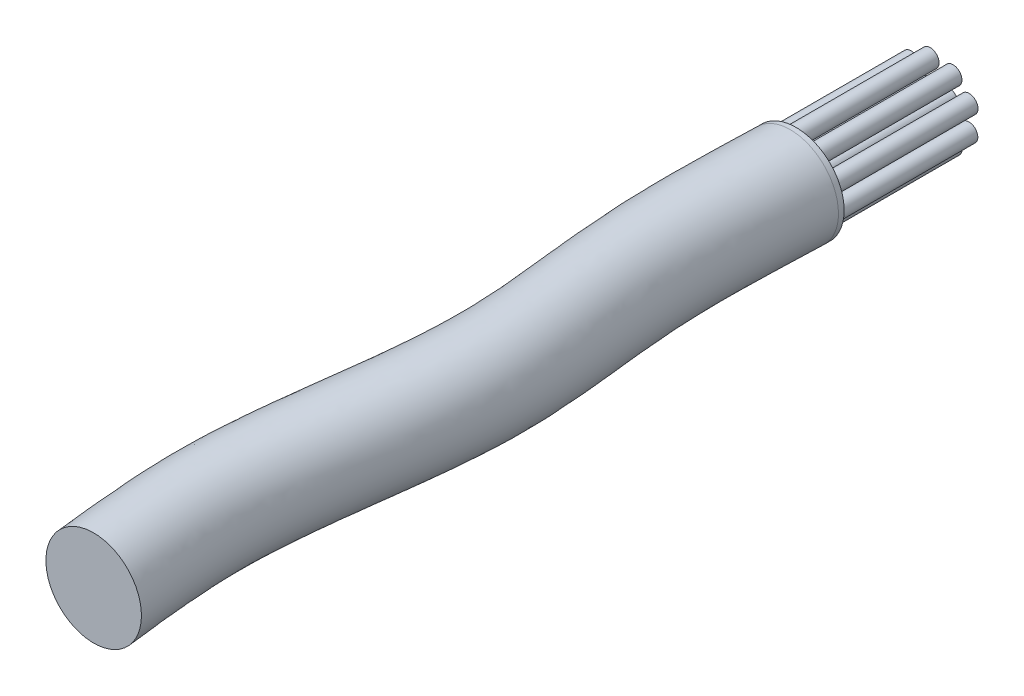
ISO-10303-21;
HEADER;
FILE_DESCRIPTION(('STEP AP214'),'2;1');
FILE_NAME('part.step','',(''),(''),'','','');
FILE_SCHEMA(('AUTOMOTIVE_DESIGN { 1 0 10303 214 1 1 1 1 }'));
ENDSEC;
DATA;
#1=APPLICATION_CONTEXT('core data for automotive mechanical design processes');
#2=APPLICATION_PROTOCOL_DEFINITION('international standard','automotive_design',2000,#1);
#3=PRODUCT_CONTEXT('',#1,'mechanical');
#4=PRODUCT('Part','Part','',(#3));
#5=PRODUCT_RELATED_PRODUCT_CATEGORY('part','',(#4));
#6=PRODUCT_DEFINITION_FORMATION('','',#4);
#7=PRODUCT_DEFINITION_CONTEXT('part definition',#1,'design');
#8=PRODUCT_DEFINITION('design','',#6,#7);
#9=PRODUCT_DEFINITION_SHAPE('','',#8);
#10=(LENGTH_UNIT() NAMED_UNIT(*) SI_UNIT(.MILLI.,.METRE.));
#11=(NAMED_UNIT(*) PLANE_ANGLE_UNIT() SI_UNIT($,.RADIAN.));
#12=(NAMED_UNIT(*) SI_UNIT($,.STERADIAN.) SOLID_ANGLE_UNIT());
#13=UNCERTAINTY_MEASURE_WITH_UNIT(LENGTH_MEASURE(1.E-05),#10,'distance_accuracy_value','');
#14=(GEOMETRIC_REPRESENTATION_CONTEXT(3) GLOBAL_UNCERTAINTY_ASSIGNED_CONTEXT((#13)) GLOBAL_UNIT_ASSIGNED_CONTEXT((#10,
#11,#12)) REPRESENTATION_CONTEXT('',''));
#15=CARTESIAN_POINT('',(0.,0.,0.));
#16=DIRECTION('',(0.,0.,1.));
#17=DIRECTION('',(1.,0.,0.));
#18=AXIS2_PLACEMENT_3D('',#15,#16,#17);
#19=CARTESIAN_POINT('',(-3.457918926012,0.,-50.4254425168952));
#20=DIRECTION('',(0.,0.,1.));
#21=DIRECTION('',(0.,-1.00000000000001,0.));
#22=AXIS2_PLACEMENT_3D('',#19,#20,#21);
#23=PLANE('',#22);
#24=CARTESIAN_POINT('',(-0.550298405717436,-2.32426928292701,-50.4254425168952));
#25=DIRECTION('',(0.,0.,1.));
#26=DIRECTION('',(0.,-1.00000000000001,0.));
#27=AXIS2_PLACEMENT_3D('',#24,#25,#26);
#28=CIRCLE('',#27,0.635);
#29=CARTESIAN_POINT('',(-0.550298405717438,-2.95926928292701,-50.4254425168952));
#30=VERTEX_POINT('',#29);
#31=EDGE_CURVE('E24',#30,#30,#28,.F.);
#32=ORIENTED_EDGE('',*,*,#31,.F.);
#33=EDGE_LOOP('',(#32));
#34=FACE_BOUND('',#33,.T.);
#35=CARTESIAN_POINT('',(0.847747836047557,0.566836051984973,-50.4254425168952));
#36=DIRECTION('',(0.,0.,1.));
#37=DIRECTION('',(0.,-1.00000000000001,0.));
#38=AXIS2_PLACEMENT_3D('',#35,#36,#37);
#39=CIRCLE('',#38,0.635);
#40=CARTESIAN_POINT('',(0.847747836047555,-0.0681639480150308,-50.4254425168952));
#41=VERTEX_POINT('',#40);
#42=EDGE_CURVE('E32',#41,#41,#39,.F.);
#43=ORIENTED_EDGE('',*,*,#42,.F.);
#44=EDGE_LOOP('',(#43));
#45=FACE_BOUND('',#44,.T.);
#46=CARTESIAN_POINT('',(-1.89405158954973,1.53053783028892,-50.4254425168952));
#47=DIRECTION('',(0.,0.,1.));
#48=DIRECTION('',(0.,-1.00000000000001,0.));
#49=AXIS2_PLACEMENT_3D('',#46,#47,#48);
#50=CIRCLE('',#49,0.635);
#51=CARTESIAN_POINT('',(-1.89405158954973,0.895537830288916,-50.4254425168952));
#52=VERTEX_POINT('',#51);
#53=EDGE_CURVE('E40',#52,#52,#50,.F.);
#54=ORIENTED_EDGE('',*,*,#53,.F.);
#55=EDGE_LOOP('',(#54));
#56=FACE_BOUND('',#55,.T.);
#57=CARTESIAN_POINT('',(-1.93477138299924,-1.52344667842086,-50.4254425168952));
#58=DIRECTION('',(0.,0.,1.));
#59=DIRECTION('',(0.,-1.00000000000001,0.));
#60=AXIS2_PLACEMENT_3D('',#57,#58,#59);
#61=CIRCLE('',#60,0.635);
#62=CARTESIAN_POINT('',(-1.93477138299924,-2.15844667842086,-50.4254425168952));
#63=VERTEX_POINT('',#62);
#64=EDGE_CURVE('E46',#63,#63,#61,.F.);
#65=ORIENTED_EDGE('',*,*,#64,.F.);
#66=EDGE_LOOP('',(#65));
#67=FACE_BOUND('',#66,.T.);
#68=CARTESIAN_POINT('',(2.25936734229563,-0.817636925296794,-50.4254425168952));
#69=DIRECTION('',(0.,0.,1.));
#70=DIRECTION('',(0.,-1.00000000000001,0.));
#71=AXIS2_PLACEMENT_3D('',#68,#69,#70);
#72=CIRCLE('',#71,0.635);
#73=CARTESIAN_POINT('',(2.25936734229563,-1.4526369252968,-50.4254425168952));
#74=VERTEX_POINT('',#73);
#75=EDGE_CURVE('E52',#74,#74,#72,.F.);
#76=ORIENTED_EDGE('',*,*,#75,.F.);
#77=EDGE_LOOP('',(#76));
#78=FACE_BOUND('',#77,.T.);
#79=CARTESIAN_POINT('',(1.11921312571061,2.16848126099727,-50.4254425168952));
#80=DIRECTION('',(0.,0.,1.));
#81=DIRECTION('',(0.,-1.00000000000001,0.));
#82=AXIS2_PLACEMENT_3D('',#79,#80,#81);
#83=CIRCLE('',#82,0.635);
#84=CARTESIAN_POINT('',(1.11921312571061,1.53348126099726,-50.4254425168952));
#85=VERTEX_POINT('',#84);
#86=EDGE_CURVE('E58',#85,#85,#83,.F.);
#87=ORIENTED_EDGE('',*,*,#86,.F.);
#88=EDGE_LOOP('',(#87));
#89=FACE_BOUND('',#88,.T.);
#90=CARTESIAN_POINT('',(3.45791892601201,0.,-50.4254425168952));
#91=CARTESIAN_POINT('',(3.45791892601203,-6.85800000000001,-50.4254425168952));
#92=CARTESIAN_POINT('',(-3.457918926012,-6.85800000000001,-50.4254425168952));
#93=CARTESIAN_POINT('',(-3.457918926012,0.,-50.4254425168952));
#94=CARTESIAN_POINT('',(-3.45791892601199,6.85799999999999,-50.4254425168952));
#95=CARTESIAN_POINT('',(3.45791892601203,6.85800000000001,-50.4254425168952));
#96=CARTESIAN_POINT('',(3.45791892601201,0.,-50.4254425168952));
#97=(BOUNDED_CURVE() B_SPLINE_CURVE(3,(#90,#91,#92,#93,#94,#95,#96),.UNSPECIFIED.,.T.,
.F.) B_SPLINE_CURVE_WITH_KNOTS((4,3,4),(0.,0.5,1.),
.UNSPECIFIED.) CURVE() GEOMETRIC_REPRESENTATION_ITEM() RATIONAL_B_SPLINE_CURVE((1.,
0.333333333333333,0.333333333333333,1.,0.333333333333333,0.333333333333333,1.)) REPRESENTATION_ITEM(''));
#98=CARTESIAN_POINT('',(3.45791892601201,0.,-50.4254425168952));
#99=VERTEX_POINT('',#98);
#100=EDGE_CURVE('E69',#99,#99,#97,.F.);
#101=ORIENTED_EDGE('',*,*,#100,.F.);
#102=EDGE_LOOP('',(#101));
#103=FACE_BOUND('',#102,.T.);
#104=CARTESIAN_POINT('',(2.2729406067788,0.960460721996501,-50.4254425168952));
#105=DIRECTION('',(0.,0.,1.));
#106=DIRECTION('',(0.,-1.00000000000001,0.));
#107=AXIS2_PLACEMENT_3D('',#104,#105,#106);
#108=CIRCLE('',#107,0.635);
#109=CARTESIAN_POINT('',(2.2729406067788,0.325460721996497,-50.4254425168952));
#110=VERTEX_POINT('',#109);
#111=EDGE_CURVE('E55',#110,#110,#108,.F.);
#112=ORIENTED_EDGE('',*,*,#111,.F.);
#113=EDGE_LOOP('',(#112));
#114=FACE_BOUND('',#113,.T.);
#115=CARTESIAN_POINT('',(1.1327863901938,-2.13424358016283,-50.4254425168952));
#116=DIRECTION('',(0.,0.,1.));
#117=DIRECTION('',(0.,-1.00000000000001,0.));
#118=AXIS2_PLACEMENT_3D('',#115,#116,#117);
#119=CIRCLE('',#118,0.635);
#120=CARTESIAN_POINT('',(1.1327863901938,-2.76924358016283,-50.4254425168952));
#121=VERTEX_POINT('',#120);
#122=EDGE_CURVE('E49',#121,#121,#119,.F.);
#123=ORIENTED_EDGE('',*,*,#122,.F.);
#124=EDGE_LOOP('',(#123));
#125=FACE_BOUND('',#124,.T.);
#126=CARTESIAN_POINT('',(-2.46412869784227,0.,-50.4254425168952));
#127=DIRECTION('',(0.,0.,1.));
#128=DIRECTION('',(0.,-1.00000000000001,0.));
#129=AXIS2_PLACEMENT_3D('',#126,#127,#128);
#130=CIRCLE('',#129,0.635);
#131=CARTESIAN_POINT('',(-2.46412869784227,-0.635000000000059,-50.4254425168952));
#132=VERTEX_POINT('',#131);
#133=EDGE_CURVE('E43',#132,#132,#130,.F.);
#134=ORIENTED_EDGE('',*,*,#133,.F.);
#135=EDGE_LOOP('',(#134));
#136=FACE_BOUND('',#135,.T.);
#137=CARTESIAN_POINT('',(-0.52315187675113,2.41280002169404,-50.4254425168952));
#138=DIRECTION('',(0.,0.,1.));
#139=DIRECTION('',(0.,-1.00000000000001,0.));
#140=AXIS2_PLACEMENT_3D('',#137,#138,#139);
#141=CIRCLE('',#140,0.635);
#142=CARTESIAN_POINT('',(-0.523151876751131,1.77780002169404,-50.4254425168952));
#143=VERTEX_POINT('',#142);
#144=EDGE_CURVE('E37',#143,#143,#141,.F.);
#145=ORIENTED_EDGE('',*,*,#144,.F.);
#146=EDGE_LOOP('',(#145));
#147=FACE_BOUND('',#146,.T.);
#148=CARTESIAN_POINT('',(0.,-0.790490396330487,-50.4254425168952));
#149=DIRECTION('',(0.,0.,1.));
#150=DIRECTION('',(0.,-1.00000000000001,0.));
#151=AXIS2_PLACEMENT_3D('',#148,#149,#150);
#152=CIRCLE('',#151,0.635);
#153=CARTESIAN_POINT('',(0.,-1.42549039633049,-50.4254425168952));
#154=VERTEX_POINT('',#153);
#155=EDGE_CURVE('E28',#154,#154,#152,.F.);
#156=ORIENTED_EDGE('',*,*,#155,.F.);
#157=EDGE_LOOP('',(#156));
#158=FACE_BOUND('',#157,.T.);
#159=CARTESIAN_POINT('',(-0.631737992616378,0.553262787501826,-50.4254425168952));
#160=DIRECTION('',(0.,0.,1.));
#161=DIRECTION('',(0.,-1.00000000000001,0.));
#162=AXIS2_PLACEMENT_3D('',#159,#160,#161);
#163=CIRCLE('',#162,0.635);
#164=CARTESIAN_POINT('',(-0.63173799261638,-0.0817372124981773,-50.4254425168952));
#165=VERTEX_POINT('',#164);
#166=EDGE_CURVE('E10',#165,#165,#163,.F.);
#167=ORIENTED_EDGE('',*,*,#166,.F.);
#168=EDGE_LOOP('',(#167));
#169=FACE_BOUND('',#168,.T.);
#170=ADVANCED_FACE('F15',(#34,#45,#56,#67,#78,#89,#103,#114,#125,#136,#147,#158,#169),#23,.F.);
#171=CARTESIAN_POINT('',(3.42900000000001,0.,0.));
#172=CARTESIAN_POINT('',(3.07501958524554,0.,-2.99527313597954));
#173=CARTESIAN_POINT('',(2.36671042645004,0.,-8.98876686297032));
#174=CARTESIAN_POINT('',(3.43309907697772,0.,-17.693750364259));
#175=CARTESIAN_POINT('',(4.82851472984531,0.,-28.3588113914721));
#176=CARTESIAN_POINT('',(3.02028988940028,0.,-38.8403067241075));
#177=CARTESIAN_POINT('',(3.3120914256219,0.,-46.2920632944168));
#178=CARTESIAN_POINT('',(3.45791892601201,0.,-50.0160705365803));
#179=CARTESIAN_POINT('',(3.42900000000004,6.85799999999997,0.));
#180=CARTESIAN_POINT('',(3.07501958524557,6.85799999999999,-2.99527313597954));
#181=CARTESIAN_POINT('',(2.36671042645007,6.85800000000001,-8.98876686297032));
#182=CARTESIAN_POINT('',(3.43309907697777,6.8579999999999,-17.693750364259));
#183=CARTESIAN_POINT('',(4.82851472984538,6.85799999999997,-28.3588113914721));
#184=CARTESIAN_POINT('',(3.02028988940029,6.85799999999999,-38.8403067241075));
#185=CARTESIAN_POINT('',(3.31209142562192,6.85799999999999,-46.2920632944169));
#186=CARTESIAN_POINT('',(3.45791892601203,6.85800000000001,-50.0160705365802));
#187=CARTESIAN_POINT('',(-3.42899999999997,6.85799999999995,0.));
#188=CARTESIAN_POINT('',(-3.78241312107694,6.85800000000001,-3.23216219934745));
#189=CARTESIAN_POINT('',(-4.48958713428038,6.85799999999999,-9.69966716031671));
#190=CARTESIAN_POINT('',(-3.12921139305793,6.85799999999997,-19.8261971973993));
#191=CARTESIAN_POINT('',(-2.06789855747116,6.85799999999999,-28.7395737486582));
#192=CARTESIAN_POINT('',(-3.80122567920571,6.85799999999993,-39.1997907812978));
#193=CARTESIAN_POINT('',(-3.57231619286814,6.85799999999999,-46.4924867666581));
#194=CARTESIAN_POINT('',(-3.45791892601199,6.85799999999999,-50.1370036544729));
#195=CARTESIAN_POINT('',(-3.429,0.,0.));
#196=CARTESIAN_POINT('',(-3.78241312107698,0.,-3.23216219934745));
#197=CARTESIAN_POINT('',(-4.4895871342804,0.,-9.69966716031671));
#198=CARTESIAN_POINT('',(-3.12921139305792,0.,-19.8261971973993));
#199=CARTESIAN_POINT('',(-2.06789855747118,0.,-28.7395737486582));
#200=CARTESIAN_POINT('',(-3.80122567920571,0.,-39.1997907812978));
#201=CARTESIAN_POINT('',(-3.57231619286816,0.,-46.4924867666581));
#202=CARTESIAN_POINT('',(-3.457918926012,0.,-50.1370036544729));
#203=CARTESIAN_POINT('',(-3.42899999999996,-6.85800000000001,0.));
#204=CARTESIAN_POINT('',(-3.78241312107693,-6.85800000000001,-3.23216219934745));
#205=CARTESIAN_POINT('',(-4.48958713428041,-6.85800000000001,-9.69966716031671));
#206=CARTESIAN_POINT('',(-3.12921139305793,-6.85800000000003,-19.8261971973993));
#207=CARTESIAN_POINT('',(-2.06789855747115,-6.85800000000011,-28.7395737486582));
#208=CARTESIAN_POINT('',(-3.80122567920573,-6.85800000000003,-39.1997907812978));
#209=CARTESIAN_POINT('',(-3.57231619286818,-6.85800000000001,-46.4924867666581));
#210=CARTESIAN_POINT('',(-3.457918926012,-6.85800000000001,-50.1370036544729));
#211=CARTESIAN_POINT('',(3.42900000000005,-6.85800000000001,0.));
#212=CARTESIAN_POINT('',(3.07501958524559,-6.85800000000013,-2.99527313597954));
#213=CARTESIAN_POINT('',(2.36671042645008,-6.85800000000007,-8.98876686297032));
#214=CARTESIAN_POINT('',(3.43309907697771,-6.85800000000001,-17.693750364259));
#215=CARTESIAN_POINT('',(4.82851472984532,-6.85800000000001,-28.3588113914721));
#216=CARTESIAN_POINT('',(3.02028988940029,-6.85800000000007,-38.8403067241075));
#217=CARTESIAN_POINT('',(3.31209142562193,-6.85799999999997,-46.2920632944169));
#218=CARTESIAN_POINT('',(3.45791892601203,-6.85800000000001,-50.0160705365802));
#219=CARTESIAN_POINT('',(3.42900000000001,0.,0.));
#220=CARTESIAN_POINT('',(3.07501958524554,0.,-2.99527313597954));
#221=CARTESIAN_POINT('',(2.36671042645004,0.,-8.98876686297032));
#222=CARTESIAN_POINT('',(3.43309907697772,0.,-17.693750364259));
#223=CARTESIAN_POINT('',(4.82851472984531,0.,-28.3588113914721));
#224=CARTESIAN_POINT('',(3.02028988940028,0.,-38.8403067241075));
#225=CARTESIAN_POINT('',(3.3120914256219,0.,-46.2920632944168));
#226=CARTESIAN_POINT('',(3.45791892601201,0.,-50.0160705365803));
#227=(BOUNDED_SURFACE() B_SPLINE_SURFACE(3,3,((#171,#172,#173,#174,#175,#176,#177,#178),(#179,
#180,#181,#182,#183,#184,#185,#186),(#187,#188,#189,#190,#191,#192,#193,#194),(#195,#196,#197,
#198,#199,#200,#201,#202),(#203,#204,#205,#206,#207,#208,#209,#210),(#211,#212,#213,#214,#215,
#216,#217,#218),(#219,#220,#221,#222,#223,#224,#225,#226)),.UNSPECIFIED.,.T.,.F.,
.F.) B_SPLINE_SURFACE_WITH_KNOTS((4,3,4),(4,1,1,1,1,4),(0.,0.5,1.),(0.,0.185525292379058,
0.371233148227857,0.559124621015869,0.779673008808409,1.),
.UNSPECIFIED.) GEOMETRIC_REPRESENTATION_ITEM() RATIONAL_B_SPLINE_SURFACE(((1.,1.,1.,1.,1.,1.,1.,
1.),(0.333333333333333,0.333333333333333,0.333333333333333,0.333333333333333,0.333333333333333,
0.333333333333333,0.333333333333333,0.333333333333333),(0.333333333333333,0.333333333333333,
0.333333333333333,0.333333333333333,0.333333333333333,0.333333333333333,0.333333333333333,
0.333333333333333),(1.,1.,1.,1.,1.,1.,1.,1.),(0.333333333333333,0.333333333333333,
0.333333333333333,0.333333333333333,0.333333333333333,0.333333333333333,0.333333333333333,
0.333333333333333),(0.333333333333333,0.333333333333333,0.333333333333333,0.333333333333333,
0.333333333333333,0.333333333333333,0.333333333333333,0.333333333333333),(1.,1.,1.,1.,1.,1.,1.,1.))) REPRESENTATION_ITEM('') SURFACE());
#228=CARTESIAN_POINT('',(0.,0.,0.));
#229=DIRECTION('',(0.,0.,1.));
#230=DIRECTION('',(1.,0.,0.));
#231=AXIS2_PLACEMENT_3D('',#228,#229,#230);
#232=CIRCLE('',#231,3.429);
#233=CARTESIAN_POINT('',(3.42900000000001,0.,0.));
#234=VERTEX_POINT('',#233);
#235=EDGE_CURVE('E61',#234,#234,#232,.T.);
#236=CARTESIAN_POINT('',(3.45791892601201,0.,-50.0160705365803));
#237=CARTESIAN_POINT('',(3.45791892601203,6.85800000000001,-50.0160705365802));
#238=CARTESIAN_POINT('',(-3.45791892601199,6.85799999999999,-50.1370036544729));
#239=CARTESIAN_POINT('',(-3.457918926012,0.,-50.1370036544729));
#240=CARTESIAN_POINT('',(-3.457918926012,-6.85800000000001,-50.1370036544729));
#241=CARTESIAN_POINT('',(3.45791892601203,-6.85800000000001,-50.0160705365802));
#242=CARTESIAN_POINT('',(3.45791892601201,0.,-50.0160705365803));
#243=(BOUNDED_CURVE() B_SPLINE_CURVE(3,(#236,#237,#238,#239,#240,#241,#242),.UNSPECIFIED.,.T.,
.F.) B_SPLINE_CURVE_WITH_KNOTS((4,3,4),(0.,0.5,1.),
.UNSPECIFIED.) CURVE() GEOMETRIC_REPRESENTATION_ITEM() RATIONAL_B_SPLINE_CURVE((1.,
0.333333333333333,0.333333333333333,1.,0.333333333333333,0.333333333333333,1.)) REPRESENTATION_ITEM(''));
#244=CARTESIAN_POINT('',(3.45791892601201,0.,-50.0160705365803));
#245=VERTEX_POINT('',#244);
#246=EDGE_CURVE('E64',#245,#245,#243,.F.);
#247=ORIENTED_EDGE('',*,*,#235,.F.);
#248=EDGE_LOOP('',(#247));
#249=FACE_BOUND('',#248,.T.);
#250=ORIENTED_EDGE('',*,*,#246,.F.);
#251=EDGE_LOOP('',(#250));
#252=FACE_BOUND('',#251,.T.);
#253=ADVANCED_FACE('F17',(#249,#252),#227,.F.);
#254=CARTESIAN_POINT('',(0.,0.,0.));
#255=DIRECTION('',(0.,0.,1.));
#256=DIRECTION('',(1.,0.,0.));
#257=AXIS2_PLACEMENT_3D('',#254,#255,#256);
#258=PLANE('',#257);
#259=ORIENTED_EDGE('',*,*,#235,.T.);
#260=EDGE_LOOP('',(#259));
#261=FACE_BOUND('',#260,.T.);
#262=ADVANCED_FACE('F136',(#261),#258,.T.);
#263=CARTESIAN_POINT('',(3.45791892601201,0.,-50.0160705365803));
#264=CARTESIAN_POINT('',(3.45791892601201,0.,-50.4254425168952));
#265=CARTESIAN_POINT('',(3.45791892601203,-6.85800000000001,-50.0160705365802));
#266=CARTESIAN_POINT('',(3.45791892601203,-6.85800000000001,-50.4254425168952));
#267=CARTESIAN_POINT('',(-3.457918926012,-6.85800000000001,-50.1370036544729));
#268=CARTESIAN_POINT('',(-3.457918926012,-6.85800000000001,-50.4254425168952));
#269=CARTESIAN_POINT('',(-3.457918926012,0.,-50.1370036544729));
#270=CARTESIAN_POINT('',(-3.457918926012,0.,-50.4254425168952));
#271=CARTESIAN_POINT('',(-3.45791892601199,6.85799999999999,-50.1370036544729));
#272=CARTESIAN_POINT('',(-3.45791892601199,6.85799999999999,-50.4254425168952));
#273=CARTESIAN_POINT('',(3.45791892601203,6.85800000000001,-50.0160705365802));
#274=CARTESIAN_POINT('',(3.45791892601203,6.85800000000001,-50.4254425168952));
#275=CARTESIAN_POINT('',(3.45791892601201,0.,-50.0160705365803));
#276=CARTESIAN_POINT('',(3.45791892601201,0.,-50.4254425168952));
#277=(BOUNDED_SURFACE() B_SPLINE_SURFACE(3,1,((#263,#264),(#265,#266),(#267,#268),(#269,#270),
(#271,#272),(#273,#274),(#275,#276)),.UNSPECIFIED.,.T.,.F.,.F.) B_SPLINE_SURFACE_WITH_KNOTS((4,
3,4),(2,2),(0.,0.5,1.),(0.,1.),
.UNSPECIFIED.) GEOMETRIC_REPRESENTATION_ITEM() RATIONAL_B_SPLINE_SURFACE(((1.,1.),
(0.333333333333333,0.333333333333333),(0.333333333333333,0.333333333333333),(1.,1.),
(0.333333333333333,0.333333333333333),(0.333333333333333,0.333333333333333),(1.,1.))) REPRESENTATION_ITEM('') SURFACE());
#278=ORIENTED_EDGE('',*,*,#246,.T.);
#279=EDGE_LOOP('',(#278));
#280=FACE_BOUND('',#279,.T.);
#281=ORIENTED_EDGE('',*,*,#100,.T.);
#282=EDGE_LOOP('',(#281));
#283=FACE_BOUND('',#282,.T.);
#284=ADVANCED_FACE('F142',(#280,#283),#277,.T.);
#285=CARTESIAN_POINT('',(1.11921312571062,2.16848126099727,-60.5854425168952));
#286=DIRECTION('',(0.,0.,1.));
#287=DIRECTION('',(0.,-1.00000000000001,0.));
#288=AXIS2_PLACEMENT_3D('',#285,#286,#287);
#289=CYLINDRICAL_SURFACE('',#288,0.635);
#290=CARTESIAN_POINT('',(1.11921312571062,2.16848126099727,-60.5854425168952));
#291=DIRECTION('',(0.,0.,-1.));
#292=DIRECTION('',(0.,1.00000000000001,0.));
#293=AXIS2_PLACEMENT_3D('',#290,#291,#292);
#294=CIRCLE('',#293,0.635);
#295=CARTESIAN_POINT('',(1.11921312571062,2.80348126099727,-60.5854425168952));
#296=VERTEX_POINT('',#295);
#297=EDGE_CURVE('E77',#296,#296,#294,.T.);
#298=ORIENTED_EDGE('',*,*,#297,.F.);
#299=EDGE_LOOP('',(#298));
#300=FACE_BOUND('',#299,.T.);
#301=ORIENTED_EDGE('',*,*,#86,.T.);
#302=EDGE_LOOP('',(#301));
#303=FACE_BOUND('',#302,.T.);
#304=ADVANCED_FACE('F151',(#300,#303),#289,.T.);
#305=CARTESIAN_POINT('',(1.11921312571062,2.16848126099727,-60.5854425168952));
#306=DIRECTION('',(0.,0.,-1.));
#307=DIRECTION('',(0.,1.00000000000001,0.));
#308=AXIS2_PLACEMENT_3D('',#305,#306,#307);
#309=PLANE('',#308);
#310=ORIENTED_EDGE('',*,*,#297,.T.);
#311=EDGE_LOOP('',(#310));
#312=FACE_BOUND('',#311,.T.);
#313=ADVANCED_FACE('F248',(#312),#309,.T.);
#314=CARTESIAN_POINT('',(2.27294060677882,0.960460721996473,-60.5854425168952));
#315=DIRECTION('',(0.,0.,1.));
#316=DIRECTION('',(0.,-1.00000000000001,0.));
#317=AXIS2_PLACEMENT_3D('',#314,#315,#316);
#318=CYLINDRICAL_SURFACE('',#317,0.635);
#319=CARTESIAN_POINT('',(2.27294060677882,0.960460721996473,-60.5854425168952));
#320=DIRECTION('',(0.,0.,-1.));
#321=DIRECTION('',(0.,1.00000000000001,0.));
#322=AXIS2_PLACEMENT_3D('',#319,#320,#321);
#323=CIRCLE('',#322,0.635);
#324=CARTESIAN_POINT('',(2.27294060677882,1.59546072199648,-60.5854425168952));
#325=VERTEX_POINT('',#324);
#326=EDGE_CURVE('E83',#325,#325,#323,.T.);
#327=ORIENTED_EDGE('',*,*,#326,.F.);
#328=EDGE_LOOP('',(#327));
#329=FACE_BOUND('',#328,.T.);
#330=ORIENTED_EDGE('',*,*,#111,.T.);
#331=EDGE_LOOP('',(#330));
#332=FACE_BOUND('',#331,.T.);
#333=ADVANCED_FACE('F244',(#329,#332),#318,.T.);
#334=CARTESIAN_POINT('',(2.27294060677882,0.960460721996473,-60.5854425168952));
#335=DIRECTION('',(0.,0.,-1.));
#336=DIRECTION('',(0.,1.00000000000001,0.));
#337=AXIS2_PLACEMENT_3D('',#334,#335,#336);
#338=PLANE('',#337);
#339=ORIENTED_EDGE('',*,*,#326,.T.);
#340=EDGE_LOOP('',(#339));
#341=FACE_BOUND('',#340,.T.);
#342=ADVANCED_FACE('F240',(#341),#338,.T.);
#343=CARTESIAN_POINT('',(2.25936734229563,-0.817636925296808,-60.5854425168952));
#344=DIRECTION('',(0.,0.,1.));
#345=DIRECTION('',(0.,-1.00000000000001,0.));
#346=AXIS2_PLACEMENT_3D('',#343,#344,#345);
#347=CYLINDRICAL_SURFACE('',#346,0.635);
#348=CARTESIAN_POINT('',(2.25936734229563,-0.817636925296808,-60.5854425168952));
#349=DIRECTION('',(0.,0.,-1.));
#350=DIRECTION('',(0.,1.00000000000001,0.));
#351=AXIS2_PLACEMENT_3D('',#348,#349,#350);
#352=CIRCLE('',#351,0.635);
#353=CARTESIAN_POINT('',(2.25936734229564,-0.182636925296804,-60.5854425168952));
#354=VERTEX_POINT('',#353);
#355=EDGE_CURVE('E86',#354,#354,#352,.T.);
#356=ORIENTED_EDGE('',*,*,#355,.F.);
#357=EDGE_LOOP('',(#356));
#358=FACE_BOUND('',#357,.T.);
#359=ORIENTED_EDGE('',*,*,#75,.T.);
#360=EDGE_LOOP('',(#359));
#361=FACE_BOUND('',#360,.T.);
#362=ADVANCED_FACE('F236',(#358,#361),#347,.T.);
#363=CARTESIAN_POINT('',(2.25936734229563,-0.817636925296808,-60.5854425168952));
#364=DIRECTION('',(0.,0.,-1.));
#365=DIRECTION('',(0.,1.00000000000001,0.));
#366=AXIS2_PLACEMENT_3D('',#363,#364,#365);
#367=PLANE('',#366);
#368=ORIENTED_EDGE('',*,*,#355,.T.);
#369=EDGE_LOOP('',(#368));
#370=FACE_BOUND('',#369,.T.);
#371=ADVANCED_FACE('F232',(#370),#367,.T.);
#372=CARTESIAN_POINT('',(1.1327863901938,-2.13424358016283,-60.5854425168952));
#373=DIRECTION('',(0.,0.,1.));
#374=DIRECTION('',(0.,-1.00000000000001,0.));
#375=AXIS2_PLACEMENT_3D('',#372,#373,#374);
#376=CYLINDRICAL_SURFACE('',#375,0.635);
#377=CARTESIAN_POINT('',(1.1327863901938,-2.13424358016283,-60.5854425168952));
#378=DIRECTION('',(0.,0.,-1.));
#379=DIRECTION('',(0.,1.00000000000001,0.));
#380=AXIS2_PLACEMENT_3D('',#377,#378,#379);
#381=CIRCLE('',#380,0.635);
#382=CARTESIAN_POINT('',(1.1327863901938,-1.49924358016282,-60.5854425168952));
#383=VERTEX_POINT('',#382);
#384=EDGE_CURVE('E89',#383,#383,#381,.T.);
#385=ORIENTED_EDGE('',*,*,#384,.F.);
#386=EDGE_LOOP('',(#385));
#387=FACE_BOUND('',#386,.T.);
#388=ORIENTED_EDGE('',*,*,#122,.T.);
#389=EDGE_LOOP('',(#388));
#390=FACE_BOUND('',#389,.T.);
#391=ADVANCED_FACE('F228',(#387,#390),#376,.T.);
#392=CARTESIAN_POINT('',(1.1327863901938,-2.13424358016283,-60.5854425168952));
#393=DIRECTION('',(0.,0.,-1.));
#394=DIRECTION('',(0.,1.00000000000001,0.));
#395=AXIS2_PLACEMENT_3D('',#392,#393,#394);
#396=PLANE('',#395);
#397=ORIENTED_EDGE('',*,*,#384,.T.);
#398=EDGE_LOOP('',(#397));
#399=FACE_BOUND('',#398,.T.);
#400=ADVANCED_FACE('F224',(#399),#396,.T.);
#401=CARTESIAN_POINT('',(-1.93477138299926,-1.52344667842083,-60.5854425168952));
#402=DIRECTION('',(0.,0.,1.));
#403=DIRECTION('',(0.,-1.00000000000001,0.));
#404=AXIS2_PLACEMENT_3D('',#401,#402,#403);
#405=CYLINDRICAL_SURFACE('',#404,0.635);
#406=CARTESIAN_POINT('',(-1.93477138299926,-1.52344667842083,-60.5854425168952));
#407=DIRECTION('',(0.,0.,-1.));
#408=DIRECTION('',(0.,1.00000000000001,0.));
#409=AXIS2_PLACEMENT_3D('',#406,#407,#408);
#410=CIRCLE('',#409,0.635);
#411=CARTESIAN_POINT('',(-1.93477138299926,-0.888446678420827,-60.5854425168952));
#412=VERTEX_POINT('',#411);
#413=EDGE_CURVE('E92',#412,#412,#410,.T.);
#414=ORIENTED_EDGE('',*,*,#413,.F.);
#415=EDGE_LOOP('',(#414));
#416=FACE_BOUND('',#415,.T.);
#417=ORIENTED_EDGE('',*,*,#64,.T.);
#418=EDGE_LOOP('',(#417));
#419=FACE_BOUND('',#418,.T.);
#420=ADVANCED_FACE('F220',(#416,#419),#405,.T.);
#421=CARTESIAN_POINT('',(-1.93477138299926,-1.52344667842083,-60.5854425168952));
#422=DIRECTION('',(0.,0.,-1.));
#423=DIRECTION('',(0.,1.00000000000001,0.));
#424=AXIS2_PLACEMENT_3D('',#421,#422,#423);
#425=PLANE('',#424);
#426=ORIENTED_EDGE('',*,*,#413,.T.);
#427=EDGE_LOOP('',(#426));
#428=FACE_BOUND('',#427,.T.);
#429=ADVANCED_FACE('F216',(#428),#425,.T.);
#430=CARTESIAN_POINT('',(-2.46412869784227,0.,-60.5854425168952));
#431=DIRECTION('',(0.,0.,1.));
#432=DIRECTION('',(0.,-1.00000000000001,0.));
#433=AXIS2_PLACEMENT_3D('',#430,#431,#432);
#434=CYLINDRICAL_SURFACE('',#433,0.635);
#435=CARTESIAN_POINT('',(-2.46412869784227,0.,-60.5854425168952));
#436=DIRECTION('',(0.,0.,-1.));
#437=DIRECTION('',(0.,1.00000000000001,0.));
#438=AXIS2_PLACEMENT_3D('',#435,#436,#437);
#439=CIRCLE('',#438,0.635);
#440=CARTESIAN_POINT('',(-2.46412869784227,0.634999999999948,-60.5854425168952));
#441=VERTEX_POINT('',#440);
#442=EDGE_CURVE('E95',#441,#441,#439,.T.);
#443=ORIENTED_EDGE('',*,*,#442,.F.);
#444=EDGE_LOOP('',(#443));
#445=FACE_BOUND('',#444,.T.);
#446=ORIENTED_EDGE('',*,*,#133,.T.);
#447=EDGE_LOOP('',(#446));
#448=FACE_BOUND('',#447,.T.);
#449=ADVANCED_FACE('F212',(#445,#448),#434,.T.);
#450=CARTESIAN_POINT('',(-2.46412869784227,0.,-60.5854425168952));
#451=DIRECTION('',(0.,0.,-1.));
#452=DIRECTION('',(0.,1.00000000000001,0.));
#453=AXIS2_PLACEMENT_3D('',#450,#451,#452);
#454=PLANE('',#453);
#455=ORIENTED_EDGE('',*,*,#442,.T.);
#456=EDGE_LOOP('',(#455));
#457=FACE_BOUND('',#456,.T.);
#458=ADVANCED_FACE('F208',(#457),#454,.T.);
#459=CARTESIAN_POINT('',(-1.89405158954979,1.530537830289,-60.5854425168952));
#460=DIRECTION('',(0.,0.,1.));
#461=DIRECTION('',(0.,-1.00000000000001,0.));
#462=AXIS2_PLACEMENT_3D('',#459,#460,#461);
#463=CYLINDRICAL_SURFACE('',#462,0.635);
#464=CARTESIAN_POINT('',(-1.89405158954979,1.530537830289,-60.5854425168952));
#465=DIRECTION('',(0.,0.,-1.));
#466=DIRECTION('',(0.,1.00000000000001,0.));
#467=AXIS2_PLACEMENT_3D('',#464,#465,#466);
#468=CIRCLE('',#467,0.635);
#469=CARTESIAN_POINT('',(-1.89405158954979,2.16553783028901,-60.5854425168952));
#470=VERTEX_POINT('',#469);
#471=EDGE_CURVE('E98',#470,#470,#468,.T.);
#472=ORIENTED_EDGE('',*,*,#471,.F.);
#473=EDGE_LOOP('',(#472));
#474=FACE_BOUND('',#473,.T.);
#475=ORIENTED_EDGE('',*,*,#53,.T.);
#476=EDGE_LOOP('',(#475));
#477=FACE_BOUND('',#476,.T.);
#478=ADVANCED_FACE('F204',(#474,#477),#463,.T.);
#479=CARTESIAN_POINT('',(-1.89405158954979,1.530537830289,-60.5854425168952));
#480=DIRECTION('',(0.,0.,-1.));
#481=DIRECTION('',(0.,1.00000000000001,0.));
#482=AXIS2_PLACEMENT_3D('',#479,#480,#481);
#483=PLANE('',#482);
#484=ORIENTED_EDGE('',*,*,#471,.T.);
#485=EDGE_LOOP('',(#484));
#486=FACE_BOUND('',#485,.T.);
#487=ADVANCED_FACE('F200',(#486),#483,.T.);
#488=CARTESIAN_POINT('',(-0.52315187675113,2.41280002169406,-60.5854425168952));
#489=DIRECTION('',(0.,0.,1.));
#490=DIRECTION('',(0.,-1.00000000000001,0.));
#491=AXIS2_PLACEMENT_3D('',#488,#489,#490);
#492=CYLINDRICAL_SURFACE('',#491,0.635);
#493=CARTESIAN_POINT('',(-0.52315187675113,2.41280002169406,-60.5854425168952));
#494=DIRECTION('',(0.,0.,-1.));
#495=DIRECTION('',(0.,1.00000000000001,0.));
#496=AXIS2_PLACEMENT_3D('',#493,#494,#495);
#497=CIRCLE('',#496,0.635);
#498=CARTESIAN_POINT('',(-0.523151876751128,3.04780002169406,-60.5854425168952));
#499=VERTEX_POINT('',#498);
#500=EDGE_CURVE('E101',#499,#499,#497,.T.);
#501=ORIENTED_EDGE('',*,*,#500,.F.);
#502=EDGE_LOOP('',(#501));
#503=FACE_BOUND('',#502,.T.);
#504=ORIENTED_EDGE('',*,*,#144,.T.);
#505=EDGE_LOOP('',(#504));
#506=FACE_BOUND('',#505,.T.);
#507=ADVANCED_FACE('F196',(#503,#506),#492,.T.);
#508=CARTESIAN_POINT('',(-0.52315187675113,2.41280002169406,-60.5854425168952));
#509=DIRECTION('',(0.,0.,-1.));
#510=DIRECTION('',(0.,1.00000000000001,0.));
#511=AXIS2_PLACEMENT_3D('',#508,#509,#510);
#512=PLANE('',#511);
#513=ORIENTED_EDGE('',*,*,#500,.T.);
#514=EDGE_LOOP('',(#513));
#515=FACE_BOUND('',#514,.T.);
#516=ADVANCED_FACE('F192',(#515),#512,.T.);
#517=CARTESIAN_POINT('',(0.847747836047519,0.566836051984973,-60.5854425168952));
#518=DIRECTION('',(0.,0.,1.));
#519=DIRECTION('',(0.,-1.00000000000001,0.));
#520=AXIS2_PLACEMENT_3D('',#517,#518,#519);
#521=CYLINDRICAL_SURFACE('',#520,0.635);
#522=CARTESIAN_POINT('',(0.847747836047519,0.566836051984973,-60.5854425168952));
#523=DIRECTION('',(0.,0.,-1.));
#524=DIRECTION('',(0.,1.00000000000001,0.));
#525=AXIS2_PLACEMENT_3D('',#522,#523,#524);
#526=CIRCLE('',#525,0.635);
#527=CARTESIAN_POINT('',(0.84774783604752,1.20183605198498,-60.5854425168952));
#528=VERTEX_POINT('',#527);
#529=EDGE_CURVE('E104',#528,#528,#526,.T.);
#530=ORIENTED_EDGE('',*,*,#529,.F.);
#531=EDGE_LOOP('',(#530));
#532=FACE_BOUND('',#531,.T.);
#533=ORIENTED_EDGE('',*,*,#42,.T.);
#534=EDGE_LOOP('',(#533));
#535=FACE_BOUND('',#534,.T.);
#536=ADVANCED_FACE('F184',(#532,#535),#521,.T.);
#537=CARTESIAN_POINT('',(0.847747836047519,0.566836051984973,-60.5854425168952));
#538=DIRECTION('',(0.,0.,-1.));
#539=DIRECTION('',(0.,1.00000000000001,0.));
#540=AXIS2_PLACEMENT_3D('',#537,#538,#539);
#541=PLANE('',#540);
#542=ORIENTED_EDGE('',*,*,#529,.T.);
#543=EDGE_LOOP('',(#542));
#544=FACE_BOUND('',#543,.T.);
#545=ADVANCED_FACE('F174',(#544),#541,.T.);
#546=CARTESIAN_POINT('',(0.,-0.790490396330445,-60.5854425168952));
#547=DIRECTION('',(0.,0.,1.));
#548=DIRECTION('',(0.,-1.00000000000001,0.));
#549=AXIS2_PLACEMENT_3D('',#546,#547,#548);
#550=CYLINDRICAL_SURFACE('',#549,0.635);
#551=CARTESIAN_POINT('',(0.,-0.790490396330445,-60.5854425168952));
#552=DIRECTION('',(0.,0.,-1.));
#553=DIRECTION('',(0.,1.00000000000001,0.));
#554=AXIS2_PLACEMENT_3D('',#551,#552,#553);
#555=CIRCLE('',#554,0.635);
#556=CARTESIAN_POINT('',(0.,-0.155490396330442,-60.5854425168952));
#557=VERTEX_POINT('',#556);
#558=EDGE_CURVE('E107',#557,#557,#555,.T.);
#559=ORIENTED_EDGE('',*,*,#558,.F.);
#560=EDGE_LOOP('',(#559));
#561=FACE_BOUND('',#560,.T.);
#562=ORIENTED_EDGE('',*,*,#155,.T.);
#563=EDGE_LOOP('',(#562));
#564=FACE_BOUND('',#563,.T.);
#565=ADVANCED_FACE('F171',(#561,#564),#550,.T.);
#566=CARTESIAN_POINT('',(0.,-0.790490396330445,-60.5854425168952));
#567=DIRECTION('',(0.,0.,-1.));
#568=DIRECTION('',(0.,1.00000000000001,0.));
#569=AXIS2_PLACEMENT_3D('',#566,#567,#568);
#570=PLANE('',#569);
#571=ORIENTED_EDGE('',*,*,#558,.T.);
#572=EDGE_LOOP('',(#571));
#573=FACE_BOUND('',#572,.T.);
#574=ADVANCED_FACE('F173',(#573),#570,.T.);
#575=CARTESIAN_POINT('',(-0.550298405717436,-2.32426928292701,-60.5854425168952));
#576=DIRECTION('',(0.,0.,1.));
#577=DIRECTION('',(0.,-1.00000000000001,0.));
#578=AXIS2_PLACEMENT_3D('',#575,#576,#577);
#579=CYLINDRICAL_SURFACE('',#578,0.635);
#580=CARTESIAN_POINT('',(-0.550298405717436,-2.32426928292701,-60.5854425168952));
#581=DIRECTION('',(0.,0.,-1.));
#582=DIRECTION('',(0.,1.00000000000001,0.));
#583=AXIS2_PLACEMENT_3D('',#580,#581,#582);
#584=CIRCLE('',#583,0.635);
#585=CARTESIAN_POINT('',(-0.550298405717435,-1.689269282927,-60.5854425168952));
#586=VERTEX_POINT('',#585);
#587=EDGE_CURVE('E110',#586,#586,#584,.T.);
#588=ORIENTED_EDGE('',*,*,#587,.F.);
#589=EDGE_LOOP('',(#588));
#590=FACE_BOUND('',#589,.T.);
#591=ORIENTED_EDGE('',*,*,#31,.T.);
#592=EDGE_LOOP('',(#591));
#593=FACE_BOUND('',#592,.T.);
#594=ADVANCED_FACE('F130',(#590,#593),#579,.T.);
#595=CARTESIAN_POINT('',(-0.550298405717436,-2.32426928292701,-60.5854425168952));
#596=DIRECTION('',(0.,0.,-1.));
#597=DIRECTION('',(0.,1.00000000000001,0.));
#598=AXIS2_PLACEMENT_3D('',#595,#596,#597);
#599=PLANE('',#598);
#600=ORIENTED_EDGE('',*,*,#587,.T.);
#601=EDGE_LOOP('',(#600));
#602=FACE_BOUND('',#601,.T.);
#603=ADVANCED_FACE('F121',(#602),#599,.T.);
#604=CARTESIAN_POINT('',(-0.631737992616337,0.553262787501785,-60.5854425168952));
#605=DIRECTION('',(0.,0.,1.));
#606=DIRECTION('',(0.,-1.00000000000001,0.));
#607=AXIS2_PLACEMENT_3D('',#604,#605,#606);
#608=CYLINDRICAL_SURFACE('',#607,0.635);
#609=CARTESIAN_POINT('',(-0.631737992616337,0.553262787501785,-60.5854425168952));
#610=DIRECTION('',(0.,0.,-1.));
#611=DIRECTION('',(0.,1.00000000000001,0.));
#612=AXIS2_PLACEMENT_3D('',#609,#610,#611);
#613=CIRCLE('',#612,0.635);
#614=CARTESIAN_POINT('',(-0.631737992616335,1.18826278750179,-60.5854425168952));
#615=VERTEX_POINT('',#614);
#616=EDGE_CURVE('E113',#615,#615,#613,.T.);
#617=ORIENTED_EDGE('',*,*,#616,.F.);
#618=EDGE_LOOP('',(#617));
#619=FACE_BOUND('',#618,.T.);
#620=ORIENTED_EDGE('',*,*,#166,.T.);
#621=EDGE_LOOP('',(#620));
#622=FACE_BOUND('',#621,.T.);
#623=ADVANCED_FACE('F119',(#619,#622),#608,.T.);
#624=CARTESIAN_POINT('',(-0.631737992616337,0.553262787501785,-60.5854425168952));
#625=DIRECTION('',(0.,0.,-1.));
#626=DIRECTION('',(0.,1.00000000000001,0.));
#627=AXIS2_PLACEMENT_3D('',#624,#625,#626);
#628=PLANE('',#627);
#629=ORIENTED_EDGE('',*,*,#616,.T.);
#630=EDGE_LOOP('',(#629));
#631=FACE_BOUND('',#630,.T.);
#632=ADVANCED_FACE('F117',(#631),#628,.T.);
#633=CLOSED_SHELL('',(#170,#253,#262,#284,#304,#313,#333,#342,#362,#371,#391,#400,#420,#429,
#449,#458,#478,#487,#507,#516,#536,#545,#565,#574,#594,#603,#623,#632));
#634=MANIFOLD_SOLID_BREP('B1',#633);
#635=ADVANCED_BREP_SHAPE_REPRESENTATION('',(#18,#634),#14);
#636=SHAPE_DEFINITION_REPRESENTATION(#9,#635);
ENDSEC;
END-ISO-10303-21;
